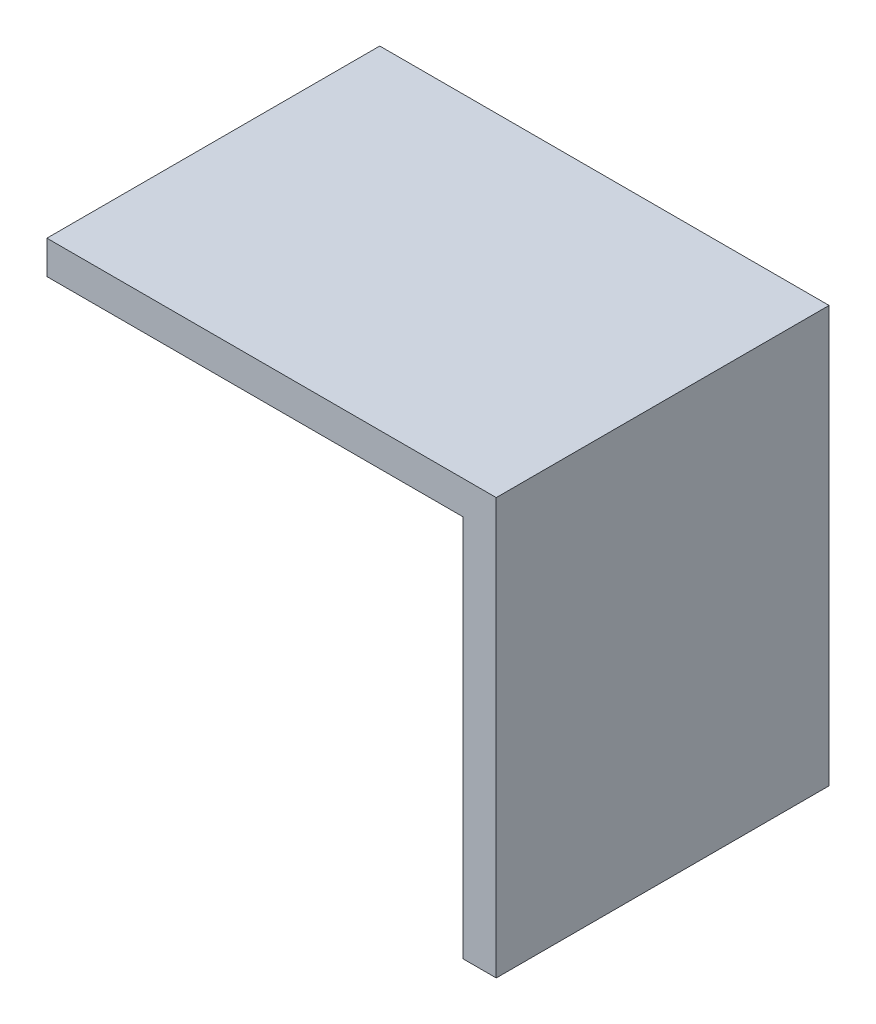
ISO-10303-21;
HEADER;
FILE_DESCRIPTION(('STEP AP214'),'2;1');
FILE_NAME('part.step','',(''),(''),'','','');
FILE_SCHEMA(('AUTOMOTIVE_DESIGN { 1 0 10303 214 1 1 1 1 }'));
ENDSEC;
DATA;
#1=APPLICATION_CONTEXT('core data for automotive mechanical design processes');
#2=APPLICATION_PROTOCOL_DEFINITION('international standard','automotive_design',2000,#1);
#3=PRODUCT_CONTEXT('',#1,'mechanical');
#4=PRODUCT('Part','Part','',(#3));
#5=PRODUCT_RELATED_PRODUCT_CATEGORY('part','',(#4));
#6=PRODUCT_DEFINITION_FORMATION('','',#4);
#7=PRODUCT_DEFINITION_CONTEXT('part definition',#1,'design');
#8=PRODUCT_DEFINITION('design','',#6,#7);
#9=PRODUCT_DEFINITION_SHAPE('','',#8);
#10=(LENGTH_UNIT() NAMED_UNIT(*) SI_UNIT(.MILLI.,.METRE.));
#11=(NAMED_UNIT(*) PLANE_ANGLE_UNIT() SI_UNIT($,.RADIAN.));
#12=(NAMED_UNIT(*) SI_UNIT($,.STERADIAN.) SOLID_ANGLE_UNIT());
#13=UNCERTAINTY_MEASURE_WITH_UNIT(LENGTH_MEASURE(1.E-05),#10,'distance_accuracy_value','');
#14=(GEOMETRIC_REPRESENTATION_CONTEXT(3) GLOBAL_UNCERTAINTY_ASSIGNED_CONTEXT((#13)) GLOBAL_UNIT_ASSIGNED_CONTEXT((#10,
#11,#12)) REPRESENTATION_CONTEXT('',''));
#15=CARTESIAN_POINT('',(0.,0.,0.));
#16=DIRECTION('',(0.,0.,1.));
#17=DIRECTION('',(1.,0.,0.));
#18=AXIS2_PLACEMENT_3D('',#15,#16,#17);
#19=CARTESIAN_POINT('',(-23.88461538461,-27.88461538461,80.));
#20=DIRECTION('',(0.,0.,-1.));
#21=DIRECTION('',(0.,-1.,0.));
#22=AXIS2_PLACEMENT_3D('',#19,#20,#21);
#23=PLANE('',#22);
#24=DIRECTION('',(0.,1.,0.));
#25=VECTOR('',#24,1.);
#26=CARTESIAN_POINT('',(-100.,-8.,80.));
#27=LINE('',#26,#25);
#28=CARTESIAN_POINT('',(-100.,-8.,80.));
#29=VERTEX_POINT('',#28);
#30=CARTESIAN_POINT('',(-100.,0.,80.));
#31=VERTEX_POINT('',#30);
#32=EDGE_CURVE('E24',#29,#31,#27,.T.);
#33=ORIENTED_EDGE('',*,*,#32,.F.);
#34=DIRECTION('',(-1.,0.,0.));
#35=VECTOR('',#34,1.);
#36=CARTESIAN_POINT('',(0.,-8.,80.));
#37=LINE('',#36,#35);
#38=CARTESIAN_POINT('',(0.,-8.,80.));
#39=VERTEX_POINT('',#38);
#40=EDGE_CURVE('E129',#39,#29,#37,.T.);
#41=ORIENTED_EDGE('',*,*,#40,.F.);
#42=DIRECTION('',(0.,1.,0.));
#43=VECTOR('',#42,1.);
#44=CARTESIAN_POINT('',(0.,-100.,80.));
#45=LINE('',#44,#43);
#46=CARTESIAN_POINT('',(0.,-100.,80.));
#47=VERTEX_POINT('',#46);
#48=EDGE_CURVE('E116',#47,#39,#45,.T.);
#49=ORIENTED_EDGE('',*,*,#48,.F.);
#50=DIRECTION('',(-1.,0.,0.));
#51=VECTOR('',#50,1.);
#52=CARTESIAN_POINT('',(8.,-100.,80.));
#53=LINE('',#52,#51);
#54=CARTESIAN_POINT('',(8.,-100.,80.));
#55=VERTEX_POINT('',#54);
#56=EDGE_CURVE('E117',#55,#47,#53,.T.);
#57=ORIENTED_EDGE('',*,*,#56,.F.);
#58=DIRECTION('',(0.,-1.,0.));
#59=VECTOR('',#58,1.);
#60=CARTESIAN_POINT('',(8.,0.,80.));
#61=LINE('',#60,#59);
#62=CARTESIAN_POINT('',(8.,0.,80.));
#63=VERTEX_POINT('',#62);
#64=EDGE_CURVE('E99',#63,#55,#61,.T.);
#65=ORIENTED_EDGE('',*,*,#64,.F.);
#66=DIRECTION('',(1.,0.,0.));
#67=VECTOR('',#66,1.);
#68=CARTESIAN_POINT('',(-100.,0.,80.));
#69=LINE('',#68,#67);
#70=EDGE_CURVE('E103',#31,#63,#69,.T.);
#71=ORIENTED_EDGE('',*,*,#70,.F.);
#72=EDGE_LOOP('',(#33,#41,#49,#57,#65,#71));
#73=FACE_BOUND('',#72,.T.);
#74=ADVANCED_FACE('F16',(#73),#23,.F.);
#75=CARTESIAN_POINT('',(-23.88461538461,-27.88461538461,0.));
#76=DIRECTION('',(0.,0.,-1.));
#77=DIRECTION('',(0.,-1.,0.));
#78=AXIS2_PLACEMENT_3D('',#75,#76,#77);
#79=PLANE('',#78);
#80=DIRECTION('',(1.,0.,0.));
#81=VECTOR('',#80,1.);
#82=CARTESIAN_POINT('',(-100.,0.,0.));
#83=LINE('',#82,#81);
#84=CARTESIAN_POINT('',(-100.,0.,0.));
#85=VERTEX_POINT('',#84);
#86=CARTESIAN_POINT('',(8.,0.,0.));
#87=VERTEX_POINT('',#86);
#88=EDGE_CURVE('E86',#85,#87,#83,.T.);
#89=ORIENTED_EDGE('',*,*,#88,.T.);
#90=DIRECTION('',(0.,-1.,0.));
#91=VECTOR('',#90,1.);
#92=CARTESIAN_POINT('',(8.,0.,0.));
#93=LINE('',#92,#91);
#94=CARTESIAN_POINT('',(8.,-100.,0.));
#95=VERTEX_POINT('',#94);
#96=EDGE_CURVE('E121',#87,#95,#93,.T.);
#97=ORIENTED_EDGE('',*,*,#96,.T.);
#98=DIRECTION('',(-1.,0.,0.));
#99=VECTOR('',#98,1.);
#100=CARTESIAN_POINT('',(8.,-100.,0.));
#101=LINE('',#100,#99);
#102=CARTESIAN_POINT('',(0.,-100.,0.));
#103=VERTEX_POINT('',#102);
#104=EDGE_CURVE('E138',#95,#103,#101,.T.);
#105=ORIENTED_EDGE('',*,*,#104,.T.);
#106=DIRECTION('',(0.,1.,0.));
#107=VECTOR('',#106,1.);
#108=CARTESIAN_POINT('',(0.,-100.,0.));
#109=LINE('',#108,#107);
#110=CARTESIAN_POINT('',(0.,-8.,0.));
#111=VERTEX_POINT('',#110);
#112=EDGE_CURVE('E115',#103,#111,#109,.T.);
#113=ORIENTED_EDGE('',*,*,#112,.T.);
#114=DIRECTION('',(-1.,0.,0.));
#115=VECTOR('',#114,1.);
#116=CARTESIAN_POINT('',(0.,-8.,0.));
#117=LINE('',#116,#115);
#118=CARTESIAN_POINT('',(-100.,-8.,0.));
#119=VERTEX_POINT('',#118);
#120=EDGE_CURVE('E89',#111,#119,#117,.T.);
#121=ORIENTED_EDGE('',*,*,#120,.T.);
#122=DIRECTION('',(0.,1.,0.));
#123=VECTOR('',#122,1.);
#124=CARTESIAN_POINT('',(-100.,-8.,0.));
#125=LINE('',#124,#123);
#126=EDGE_CURVE('E10',#119,#85,#125,.T.);
#127=ORIENTED_EDGE('',*,*,#126,.T.);
#128=EDGE_LOOP('',(#89,#97,#105,#113,#121,#127));
#129=FACE_BOUND('',#128,.T.);
#130=ADVANCED_FACE('F84',(#129),#79,.T.);
#131=CARTESIAN_POINT('',(-100.,-8.,0.));
#132=DIRECTION('',(-1.,0.,0.));
#133=DIRECTION('',(0.,0.,1.));
#134=AXIS2_PLACEMENT_3D('',#131,#132,#133);
#135=PLANE('',#134);
#136=DIRECTION('',(0.,0.,1.));
#137=VECTOR('',#136,1.);
#138=CARTESIAN_POINT('',(-100.,-8.,0.));
#139=LINE('',#138,#137);
#140=EDGE_CURVE('E148',#119,#29,#139,.T.);
#141=ORIENTED_EDGE('',*,*,#140,.T.);
#142=ORIENTED_EDGE('',*,*,#32,.T.);
#143=DIRECTION('',(0.,0.,1.));
#144=VECTOR('',#143,1.);
#145=CARTESIAN_POINT('',(-100.,0.,0.));
#146=LINE('',#145,#144);
#147=EDGE_CURVE('E95',#85,#31,#146,.T.);
#148=ORIENTED_EDGE('',*,*,#147,.F.);
#149=ORIENTED_EDGE('',*,*,#126,.F.);
#150=EDGE_LOOP('',(#141,#142,#148,#149));
#151=FACE_BOUND('',#150,.T.);
#152=ADVANCED_FACE('F101',(#151),#135,.T.);
#153=CARTESIAN_POINT('',(0.,-8.,0.));
#154=DIRECTION('',(0.,-1.,0.));
#155=DIRECTION('',(0.,0.,-1.));
#156=AXIS2_PLACEMENT_3D('',#153,#154,#155);
#157=PLANE('',#156);
#158=DIRECTION('',(0.,0.,1.));
#159=VECTOR('',#158,1.);
#160=CARTESIAN_POINT('',(0.,-8.,0.));
#161=LINE('',#160,#159);
#162=EDGE_CURVE('E111',#111,#39,#161,.T.);
#163=ORIENTED_EDGE('',*,*,#162,.T.);
#164=ORIENTED_EDGE('',*,*,#40,.T.);
#165=ORIENTED_EDGE('',*,*,#140,.F.);
#166=ORIENTED_EDGE('',*,*,#120,.F.);
#167=EDGE_LOOP('',(#163,#164,#165,#166));
#168=FACE_BOUND('',#167,.T.);
#169=ADVANCED_FACE('F159',(#168),#157,.T.);
#170=CARTESIAN_POINT('',(0.,-100.,0.));
#171=DIRECTION('',(-1.,0.,0.));
#172=DIRECTION('',(0.,0.,1.));
#173=AXIS2_PLACEMENT_3D('',#170,#171,#172);
#174=PLANE('',#173);
#175=DIRECTION('',(0.,0.,1.));
#176=VECTOR('',#175,1.);
#177=CARTESIAN_POINT('',(0.,-100.,0.));
#178=LINE('',#177,#176);
#179=EDGE_CURVE('E120',#103,#47,#178,.T.);
#180=ORIENTED_EDGE('',*,*,#179,.T.);
#181=ORIENTED_EDGE('',*,*,#48,.T.);
#182=ORIENTED_EDGE('',*,*,#162,.F.);
#183=ORIENTED_EDGE('',*,*,#112,.F.);
#184=EDGE_LOOP('',(#180,#181,#182,#183));
#185=FACE_BOUND('',#184,.T.);
#186=ADVANCED_FACE('F164',(#185),#174,.T.);
#187=CARTESIAN_POINT('',(8.,-100.,0.));
#188=DIRECTION('',(0.,-1.,0.));
#189=DIRECTION('',(0.,0.,-1.));
#190=AXIS2_PLACEMENT_3D('',#187,#188,#189);
#191=PLANE('',#190);
#192=DIRECTION('',(0.,0.,1.));
#193=VECTOR('',#192,1.);
#194=CARTESIAN_POINT('',(8.,-100.,0.));
#195=LINE('',#194,#193);
#196=EDGE_CURVE('E126',#95,#55,#195,.T.);
#197=ORIENTED_EDGE('',*,*,#196,.T.);
#198=ORIENTED_EDGE('',*,*,#56,.T.);
#199=ORIENTED_EDGE('',*,*,#179,.F.);
#200=ORIENTED_EDGE('',*,*,#104,.F.);
#201=EDGE_LOOP('',(#197,#198,#199,#200));
#202=FACE_BOUND('',#201,.T.);
#203=ADVANCED_FACE('F184',(#202),#191,.T.);
#204=CARTESIAN_POINT('',(8.,0.,0.));
#205=DIRECTION('',(1.,0.,0.));
#206=DIRECTION('',(0.,1.,0.));
#207=AXIS2_PLACEMENT_3D('',#204,#205,#206);
#208=PLANE('',#207);
#209=DIRECTION('',(0.,0.,1.));
#210=VECTOR('',#209,1.);
#211=CARTESIAN_POINT('',(8.,0.,0.));
#212=LINE('',#211,#210);
#213=EDGE_CURVE('E97',#87,#63,#212,.T.);
#214=ORIENTED_EDGE('',*,*,#213,.T.);
#215=ORIENTED_EDGE('',*,*,#64,.T.);
#216=ORIENTED_EDGE('',*,*,#196,.F.);
#217=ORIENTED_EDGE('',*,*,#96,.F.);
#218=EDGE_LOOP('',(#214,#215,#216,#217));
#219=FACE_BOUND('',#218,.T.);
#220=ADVANCED_FACE('F176',(#219),#208,.T.);
#221=CARTESIAN_POINT('',(-100.,0.,0.));
#222=DIRECTION('',(0.,1.,0.));
#223=DIRECTION('',(1.,0.,0.));
#224=AXIS2_PLACEMENT_3D('',#221,#222,#223);
#225=PLANE('',#224);
#226=ORIENTED_EDGE('',*,*,#147,.T.);
#227=ORIENTED_EDGE('',*,*,#70,.T.);
#228=ORIENTED_EDGE('',*,*,#213,.F.);
#229=ORIENTED_EDGE('',*,*,#88,.F.);
#230=EDGE_LOOP('',(#226,#227,#228,#229));
#231=FACE_BOUND('',#230,.T.);
#232=ADVANCED_FACE('F93',(#231),#225,.T.);
#233=CLOSED_SHELL('',(#74,#130,#152,#169,#186,#203,#220,#232));
#234=MANIFOLD_SOLID_BREP('B1',#233);
#235=ADVANCED_BREP_SHAPE_REPRESENTATION('',(#18,#234),#14);
#236=SHAPE_DEFINITION_REPRESENTATION(#9,#235);
ENDSEC;
END-ISO-10303-21;
